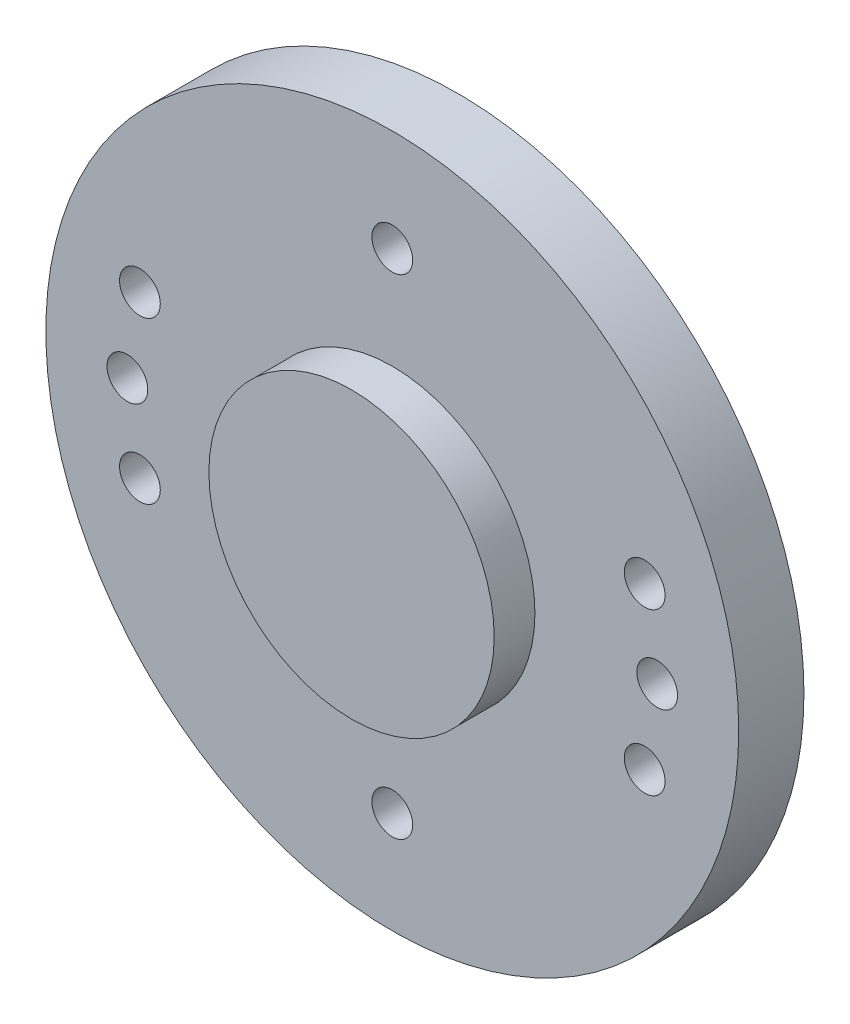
ISO-10303-21;
HEADER;
FILE_DESCRIPTION(('STEP AP214'),'2;1');
FILE_NAME('part.step','',(''),(''),'','','');
FILE_SCHEMA(('AUTOMOTIVE_DESIGN { 1 0 10303 214 1 1 1 1 }'));
ENDSEC;
DATA;
#1=APPLICATION_CONTEXT('core data for automotive mechanical design processes');
#2=APPLICATION_PROTOCOL_DEFINITION('international standard','automotive_design',2000,#1);
#3=PRODUCT_CONTEXT('',#1,'mechanical');
#4=PRODUCT('Part','Part','',(#3));
#5=PRODUCT_RELATED_PRODUCT_CATEGORY('part','',(#4));
#6=PRODUCT_DEFINITION_FORMATION('','',#4);
#7=PRODUCT_DEFINITION_CONTEXT('part definition',#1,'design');
#8=PRODUCT_DEFINITION('design','',#6,#7);
#9=PRODUCT_DEFINITION_SHAPE('','',#8);
#10=(LENGTH_UNIT() NAMED_UNIT(*) SI_UNIT(.MILLI.,.METRE.));
#11=(NAMED_UNIT(*) PLANE_ANGLE_UNIT() SI_UNIT($,.RADIAN.));
#12=(NAMED_UNIT(*) SI_UNIT($,.STERADIAN.) SOLID_ANGLE_UNIT());
#13=UNCERTAINTY_MEASURE_WITH_UNIT(LENGTH_MEASURE(1.E-05),#10,'distance_accuracy_value','');
#14=(GEOMETRIC_REPRESENTATION_CONTEXT(3) GLOBAL_UNCERTAINTY_ASSIGNED_CONTEXT((#13)) GLOBAL_UNIT_ASSIGNED_CONTEXT((#10,
#11,#12)) REPRESENTATION_CONTEXT('',''));
#15=CARTESIAN_POINT('',(0.,0.,0.));
#16=DIRECTION('',(0.,0.,1.));
#17=DIRECTION('',(1.,0.,0.));
#18=AXIS2_PLACEMENT_3D('',#15,#16,#17);
#19=CARTESIAN_POINT('',(0.,0.,0.));
#20=DIRECTION('',(0.,0.,1.));
#21=DIRECTION('',(1.,0.,0.));
#22=AXIS2_PLACEMENT_3D('',#19,#20,#21);
#23=PLANE('',#22);
#24=CARTESIAN_POINT('',(6.19230769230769,1.97618962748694,0.));
#25=DIRECTION('',(0.,0.,1.));
#26=DIRECTION('',(1.,0.,0.));
#27=AXIS2_PLACEMENT_3D('',#24,#25,#26);
#28=CIRCLE('',#27,0.500000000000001);
#29=CARTESIAN_POINT('',(6.69230769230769,1.97618962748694,0.));
#30=VERTEX_POINT('',#29);
#31=EDGE_CURVE('E100',#30,#30,#28,.T.);
#32=ORIENTED_EDGE('',*,*,#31,.T.);
#33=EDGE_LOOP('',(#32));
#34=FACE_BOUND('',#33,.T.);
#35=CARTESIAN_POINT('',(6.5,0.,0.));
#36=DIRECTION('',(0.,0.,1.));
#37=DIRECTION('',(1.,0.,0.));
#38=AXIS2_PLACEMENT_3D('',#35,#36,#37);
#39=CIRCLE('',#38,0.500000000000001);
#40=CARTESIAN_POINT('',(7.,0.,0.));
#41=VERTEX_POINT('',#40);
#42=EDGE_CURVE('E94',#41,#41,#39,.T.);
#43=ORIENTED_EDGE('',*,*,#42,.T.);
#44=EDGE_LOOP('',(#43));
#45=FACE_BOUND('',#44,.T.);
#46=CARTESIAN_POINT('',(6.19230769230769,-1.97618962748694,0.));
#47=DIRECTION('',(0.,0.,1.));
#48=DIRECTION('',(1.,0.,0.));
#49=AXIS2_PLACEMENT_3D('',#46,#47,#48);
#50=CIRCLE('',#49,0.500000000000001);
#51=CARTESIAN_POINT('',(6.69230769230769,-1.97618962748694,0.));
#52=VERTEX_POINT('',#51);
#53=EDGE_CURVE('E88',#52,#52,#50,.T.);
#54=ORIENTED_EDGE('',*,*,#53,.T.);
#55=EDGE_LOOP('',(#54));
#56=FACE_BOUND('',#55,.T.);
#57=CARTESIAN_POINT('',(-6.19230769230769,1.97618962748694,0.));
#58=DIRECTION('',(0.,0.,1.));
#59=DIRECTION('',(1.,0.,0.));
#60=AXIS2_PLACEMENT_3D('',#57,#58,#59);
#61=CIRCLE('',#60,0.5);
#62=CARTESIAN_POINT('',(-5.69230769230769,1.97618962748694,0.));
#63=VERTEX_POINT('',#62);
#64=EDGE_CURVE('E82',#63,#63,#61,.T.);
#65=ORIENTED_EDGE('',*,*,#64,.T.);
#66=EDGE_LOOP('',(#65));
#67=FACE_BOUND('',#66,.T.);
#68=CARTESIAN_POINT('',(-6.5,0.,0.));
#69=DIRECTION('',(0.,0.,1.));
#70=DIRECTION('',(1.,0.,0.));
#71=AXIS2_PLACEMENT_3D('',#68,#69,#70);
#72=CIRCLE('',#71,0.5);
#73=CARTESIAN_POINT('',(-6.,0.,0.));
#74=VERTEX_POINT('',#73);
#75=EDGE_CURVE('E76',#74,#74,#72,.T.);
#76=ORIENTED_EDGE('',*,*,#75,.T.);
#77=EDGE_LOOP('',(#76));
#78=FACE_BOUND('',#77,.T.);
#79=CARTESIAN_POINT('',(-6.19230769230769,-1.97618962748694,0.));
#80=DIRECTION('',(0.,0.,1.));
#81=DIRECTION('',(1.,0.,0.));
#82=AXIS2_PLACEMENT_3D('',#79,#80,#81);
#83=CIRCLE('',#82,0.5);
#84=CARTESIAN_POINT('',(-5.69230769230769,-1.97618962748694,0.));
#85=VERTEX_POINT('',#84);
#86=EDGE_CURVE('E70',#85,#85,#83,.T.);
#87=ORIENTED_EDGE('',*,*,#86,.T.);
#88=EDGE_LOOP('',(#87));
#89=FACE_BOUND('',#88,.T.);
#90=CARTESIAN_POINT('',(0.,-6.,0.));
#91=DIRECTION('',(0.,0.,1.));
#92=DIRECTION('',(1.,0.,0.));
#93=AXIS2_PLACEMENT_3D('',#90,#91,#92);
#94=CIRCLE('',#93,0.5);
#95=CARTESIAN_POINT('',(0.500000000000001,-6.,0.));
#96=VERTEX_POINT('',#95);
#97=EDGE_CURVE('E64',#96,#96,#94,.T.);
#98=ORIENTED_EDGE('',*,*,#97,.T.);
#99=EDGE_LOOP('',(#98));
#100=FACE_BOUND('',#99,.T.);
#101=CARTESIAN_POINT('',(0.,6.,0.));
#102=DIRECTION('',(0.,0.,1.));
#103=DIRECTION('',(1.,0.,0.));
#104=AXIS2_PLACEMENT_3D('',#101,#102,#103);
#105=CIRCLE('',#104,0.5);
#106=CARTESIAN_POINT('',(0.500000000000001,6.,0.));
#107=VERTEX_POINT('',#106);
#108=EDGE_CURVE('E58',#107,#107,#105,.T.);
#109=ORIENTED_EDGE('',*,*,#108,.T.);
#110=EDGE_LOOP('',(#109));
#111=FACE_BOUND('',#110,.T.);
#112=CARTESIAN_POINT('',(0.,0.,0.));
#113=DIRECTION('',(0.,0.,1.));
#114=DIRECTION('',(1.,0.,0.));
#115=AXIS2_PLACEMENT_3D('',#112,#113,#114);
#116=CIRCLE('',#115,8.5);
#117=CARTESIAN_POINT('',(8.5,0.,0.));
#118=VERTEX_POINT('',#117);
#119=EDGE_CURVE('E43',#118,#118,#116,.T.);
#120=ORIENTED_EDGE('',*,*,#119,.F.);
#121=EDGE_LOOP('',(#120));
#122=FACE_BOUND('',#121,.T.);
#123=CARTESIAN_POINT('',(0.,0.,0.));
#124=DIRECTION('',(0.,0.,1.));
#125=DIRECTION('',(1.,0.,0.));
#126=AXIS2_PLACEMENT_3D('',#123,#124,#125);
#127=CIRCLE('',#126,4.);
#128=CARTESIAN_POINT('',(4.,0.,0.));
#129=VERTEX_POINT('',#128);
#130=EDGE_CURVE('E10',#129,#129,#127,.F.);
#131=ORIENTED_EDGE('',*,*,#130,.F.);
#132=EDGE_LOOP('',(#131));
#133=FACE_BOUND('',#132,.T.);
#134=ADVANCED_FACE('F32',(#34,#45,#56,#67,#78,#89,#100,#111,#122,#133),#23,.F.);
#135=CARTESIAN_POINT('',(0.,0.,1.6));
#136=DIRECTION('',(0.,0.,1.));
#137=DIRECTION('',(1.,0.,0.));
#138=AXIS2_PLACEMENT_3D('',#135,#136,#137);
#139=PLANE('',#138);
#140=CARTESIAN_POINT('',(6.19230769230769,1.97618962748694,1.6));
#141=DIRECTION('',(0.,0.,1.));
#142=DIRECTION('',(1.,0.,0.));
#143=AXIS2_PLACEMENT_3D('',#140,#141,#142);
#144=CIRCLE('',#143,0.500000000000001);
#145=CARTESIAN_POINT('',(6.69230769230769,1.97618962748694,1.6));
#146=VERTEX_POINT('',#145);
#147=EDGE_CURVE('E103',#146,#146,#144,.T.);
#148=ORIENTED_EDGE('',*,*,#147,.F.);
#149=EDGE_LOOP('',(#148));
#150=FACE_BOUND('',#149,.T.);
#151=CARTESIAN_POINT('',(6.5,0.,1.6));
#152=DIRECTION('',(0.,0.,1.));
#153=DIRECTION('',(1.,0.,0.));
#154=AXIS2_PLACEMENT_3D('',#151,#152,#153);
#155=CIRCLE('',#154,0.500000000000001);
#156=CARTESIAN_POINT('',(7.,0.,1.6));
#157=VERTEX_POINT('',#156);
#158=EDGE_CURVE('E97',#157,#157,#155,.T.);
#159=ORIENTED_EDGE('',*,*,#158,.F.);
#160=EDGE_LOOP('',(#159));
#161=FACE_BOUND('',#160,.T.);
#162=CARTESIAN_POINT('',(6.19230769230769,-1.97618962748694,1.6));
#163=DIRECTION('',(0.,0.,1.));
#164=DIRECTION('',(1.,0.,0.));
#165=AXIS2_PLACEMENT_3D('',#162,#163,#164);
#166=CIRCLE('',#165,0.500000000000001);
#167=CARTESIAN_POINT('',(6.69230769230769,-1.97618962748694,1.6));
#168=VERTEX_POINT('',#167);
#169=EDGE_CURVE('E91',#168,#168,#166,.T.);
#170=ORIENTED_EDGE('',*,*,#169,.F.);
#171=EDGE_LOOP('',(#170));
#172=FACE_BOUND('',#171,.T.);
#173=CARTESIAN_POINT('',(-6.19230769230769,1.97618962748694,1.6));
#174=DIRECTION('',(0.,0.,1.));
#175=DIRECTION('',(1.,0.,0.));
#176=AXIS2_PLACEMENT_3D('',#173,#174,#175);
#177=CIRCLE('',#176,0.5);
#178=CARTESIAN_POINT('',(-5.69230769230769,1.97618962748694,1.6));
#179=VERTEX_POINT('',#178);
#180=EDGE_CURVE('E85',#179,#179,#177,.T.);
#181=ORIENTED_EDGE('',*,*,#180,.F.);
#182=EDGE_LOOP('',(#181));
#183=FACE_BOUND('',#182,.T.);
#184=CARTESIAN_POINT('',(-6.5,0.,1.6));
#185=DIRECTION('',(0.,0.,1.));
#186=DIRECTION('',(1.,0.,0.));
#187=AXIS2_PLACEMENT_3D('',#184,#185,#186);
#188=CIRCLE('',#187,0.5);
#189=CARTESIAN_POINT('',(-6.,0.,1.6));
#190=VERTEX_POINT('',#189);
#191=EDGE_CURVE('E79',#190,#190,#188,.T.);
#192=ORIENTED_EDGE('',*,*,#191,.F.);
#193=EDGE_LOOP('',(#192));
#194=FACE_BOUND('',#193,.T.);
#195=CARTESIAN_POINT('',(-6.19230769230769,-1.97618962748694,1.6));
#196=DIRECTION('',(0.,0.,1.));
#197=DIRECTION('',(1.,0.,0.));
#198=AXIS2_PLACEMENT_3D('',#195,#196,#197);
#199=CIRCLE('',#198,0.5);
#200=CARTESIAN_POINT('',(-5.69230769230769,-1.97618962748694,1.6));
#201=VERTEX_POINT('',#200);
#202=EDGE_CURVE('E73',#201,#201,#199,.T.);
#203=ORIENTED_EDGE('',*,*,#202,.F.);
#204=EDGE_LOOP('',(#203));
#205=FACE_BOUND('',#204,.T.);
#206=CARTESIAN_POINT('',(0.,-6.,1.6));
#207=DIRECTION('',(0.,0.,1.));
#208=DIRECTION('',(1.,0.,0.));
#209=AXIS2_PLACEMENT_3D('',#206,#207,#208);
#210=CIRCLE('',#209,0.5);
#211=CARTESIAN_POINT('',(0.500000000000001,-6.,1.6));
#212=VERTEX_POINT('',#211);
#213=EDGE_CURVE('E67',#212,#212,#210,.T.);
#214=ORIENTED_EDGE('',*,*,#213,.F.);
#215=EDGE_LOOP('',(#214));
#216=FACE_BOUND('',#215,.T.);
#217=CARTESIAN_POINT('',(0.,6.,1.6));
#218=DIRECTION('',(0.,0.,1.));
#219=DIRECTION('',(1.,0.,0.));
#220=AXIS2_PLACEMENT_3D('',#217,#218,#219);
#221=CIRCLE('',#220,0.5);
#222=CARTESIAN_POINT('',(0.500000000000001,6.,1.6));
#223=VERTEX_POINT('',#222);
#224=EDGE_CURVE('E61',#223,#223,#221,.T.);
#225=ORIENTED_EDGE('',*,*,#224,.F.);
#226=EDGE_LOOP('',(#225));
#227=FACE_BOUND('',#226,.T.);
#228=CARTESIAN_POINT('',(0.,0.,1.6));
#229=DIRECTION('',(0.,0.,1.));
#230=DIRECTION('',(1.,0.,0.));
#231=AXIS2_PLACEMENT_3D('',#228,#229,#230);
#232=CIRCLE('',#231,8.5);
#233=CARTESIAN_POINT('',(8.5,0.,1.6));
#234=VERTEX_POINT('',#233);
#235=EDGE_CURVE('E39',#234,#234,#232,.T.);
#236=ORIENTED_EDGE('',*,*,#235,.T.);
#237=EDGE_LOOP('',(#236));
#238=FACE_BOUND('',#237,.T.);
#239=CARTESIAN_POINT('',(0.,0.,1.6));
#240=DIRECTION('',(0.,0.,1.));
#241=DIRECTION('',(1.,0.,0.));
#242=AXIS2_PLACEMENT_3D('',#239,#240,#241);
#243=CIRCLE('',#242,3.5);
#244=CARTESIAN_POINT('',(3.5,0.,1.6));
#245=VERTEX_POINT('',#244);
#246=EDGE_CURVE('E50',#245,#245,#243,.T.);
#247=ORIENTED_EDGE('',*,*,#246,.F.);
#248=EDGE_LOOP('',(#247));
#249=FACE_BOUND('',#248,.T.);
#250=ADVANCED_FACE('F140',(#150,#161,#172,#183,#194,#205,#216,#227,#238,#249),#139,.T.);
#251=CARTESIAN_POINT('',(0.,0.,1.6));
#252=DIRECTION('',(0.,0.,-1.));
#253=DIRECTION('',(-1.,0.,0.));
#254=AXIS2_PLACEMENT_3D('',#251,#252,#253);
#255=CYLINDRICAL_SURFACE('',#254,8.5);
#256=ORIENTED_EDGE('',*,*,#235,.F.);
#257=EDGE_LOOP('',(#256));
#258=FACE_BOUND('',#257,.T.);
#259=ORIENTED_EDGE('',*,*,#119,.T.);
#260=EDGE_LOOP('',(#259));
#261=FACE_BOUND('',#260,.T.);
#262=ADVANCED_FACE('F34',(#258,#261),#255,.T.);
#263=CARTESIAN_POINT('',(0.,0.,2.6));
#264=DIRECTION('',(0.,0.,-1.));
#265=DIRECTION('',(-1.,0.,0.));
#266=AXIS2_PLACEMENT_3D('',#263,#264,#265);
#267=CYLINDRICAL_SURFACE('',#266,3.5);
#268=CARTESIAN_POINT('',(0.,0.,2.6));
#269=DIRECTION('',(0.,0.,1.));
#270=DIRECTION('',(1.,0.,0.));
#271=AXIS2_PLACEMENT_3D('',#268,#269,#270);
#272=CIRCLE('',#271,3.5);
#273=CARTESIAN_POINT('',(3.5,0.,2.6));
#274=VERTEX_POINT('',#273);
#275=EDGE_CURVE('E48',#274,#274,#272,.T.);
#276=ORIENTED_EDGE('',*,*,#275,.F.);
#277=EDGE_LOOP('',(#276));
#278=FACE_BOUND('',#277,.T.);
#279=ORIENTED_EDGE('',*,*,#246,.T.);
#280=EDGE_LOOP('',(#279));
#281=FACE_BOUND('',#280,.T.);
#282=ADVANCED_FACE('F136',(#278,#281),#267,.T.);
#283=CARTESIAN_POINT('',(0.,0.,2.6));
#284=DIRECTION('',(0.,0.,1.));
#285=DIRECTION('',(1.,0.,0.));
#286=AXIS2_PLACEMENT_3D('',#283,#284,#285);
#287=PLANE('',#286);
#288=ORIENTED_EDGE('',*,*,#275,.T.);
#289=EDGE_LOOP('',(#288));
#290=FACE_BOUND('',#289,.T.);
#291=ADVANCED_FACE('F131',(#290),#287,.T.);
#292=CARTESIAN_POINT('',(0.,0.,-2.5));
#293=DIRECTION('',(0.,0.,1.));
#294=DIRECTION('',(1.,0.,0.));
#295=AXIS2_PLACEMENT_3D('',#292,#293,#294);
#296=CYLINDRICAL_SURFACE('',#295,4.);
#297=CARTESIAN_POINT('',(0.,0.,-2.5));
#298=DIRECTION('',(0.,0.,-1.));
#299=DIRECTION('',(-1.,0.,0.));
#300=AXIS2_PLACEMENT_3D('',#297,#298,#299);
#301=CIRCLE('',#300,4.);
#302=CARTESIAN_POINT('',(-4.,0.,-2.5));
#303=VERTEX_POINT('',#302);
#304=EDGE_CURVE('E53',#303,#303,#301,.T.);
#305=ORIENTED_EDGE('',*,*,#304,.F.);
#306=EDGE_LOOP('',(#305));
#307=FACE_BOUND('',#306,.T.);
#308=ORIENTED_EDGE('',*,*,#130,.T.);
#309=EDGE_LOOP('',(#308));
#310=FACE_BOUND('',#309,.T.);
#311=ADVANCED_FACE('F126',(#307,#310),#296,.T.);
#312=CARTESIAN_POINT('',(0.,0.,-2.5));
#313=DIRECTION('',(0.,0.,-1.));
#314=DIRECTION('',(-1.,0.,0.));
#315=AXIS2_PLACEMENT_3D('',#312,#313,#314);
#316=PLANE('',#315);
#317=CARTESIAN_POINT('',(0.,0.,-2.5));
#318=DIRECTION('',(0.,0.,-1.));
#319=DIRECTION('',(-1.,0.,0.));
#320=AXIS2_PLACEMENT_3D('',#317,#318,#319);
#321=CIRCLE('',#320,2.9);
#322=CARTESIAN_POINT('',(-2.9,0.,-2.5));
#323=VERTEX_POINT('',#322);
#324=EDGE_CURVE('E107',#323,#323,#321,.T.);
#325=ORIENTED_EDGE('',*,*,#324,.F.);
#326=EDGE_LOOP('',(#325));
#327=FACE_BOUND('',#326,.T.);
#328=ORIENTED_EDGE('',*,*,#304,.T.);
#329=EDGE_LOOP('',(#328));
#330=FACE_BOUND('',#329,.T.);
#331=ADVANCED_FACE('F122',(#327,#330),#316,.T.);
#332=CARTESIAN_POINT('',(0.,6.,-2.5));
#333=DIRECTION('',(0.,0.,1.));
#334=DIRECTION('',(1.,0.,0.));
#335=AXIS2_PLACEMENT_3D('',#332,#333,#334);
#336=CYLINDRICAL_SURFACE('',#335,0.5);
#337=ORIENTED_EDGE('',*,*,#224,.T.);
#338=EDGE_LOOP('',(#337));
#339=FACE_BOUND('',#338,.T.);
#340=ORIENTED_EDGE('',*,*,#108,.F.);
#341=EDGE_LOOP('',(#340));
#342=FACE_BOUND('',#341,.T.);
#343=ADVANCED_FACE('F125',(#339,#342),#336,.F.);
#344=CARTESIAN_POINT('',(0.,-6.,-2.5));
#345=DIRECTION('',(0.,0.,1.));
#346=DIRECTION('',(1.,0.,0.));
#347=AXIS2_PLACEMENT_3D('',#344,#345,#346);
#348=CYLINDRICAL_SURFACE('',#347,0.5);
#349=ORIENTED_EDGE('',*,*,#213,.T.);
#350=EDGE_LOOP('',(#349));
#351=FACE_BOUND('',#350,.T.);
#352=ORIENTED_EDGE('',*,*,#97,.F.);
#353=EDGE_LOOP('',(#352));
#354=FACE_BOUND('',#353,.T.);
#355=ADVANCED_FACE('F181',(#351,#354),#348,.F.);
#356=CARTESIAN_POINT('',(-6.19230769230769,-1.97618962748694,-2.5));
#357=DIRECTION('',(0.,0.,1.));
#358=DIRECTION('',(1.,0.,0.));
#359=AXIS2_PLACEMENT_3D('',#356,#357,#358);
#360=CYLINDRICAL_SURFACE('',#359,0.5);
#361=ORIENTED_EDGE('',*,*,#202,.T.);
#362=EDGE_LOOP('',(#361));
#363=FACE_BOUND('',#362,.T.);
#364=ORIENTED_EDGE('',*,*,#86,.F.);
#365=EDGE_LOOP('',(#364));
#366=FACE_BOUND('',#365,.T.);
#367=ADVANCED_FACE('F192',(#363,#366),#360,.F.);
#368=CARTESIAN_POINT('',(-6.5,0.,-2.5));
#369=DIRECTION('',(0.,0.,1.));
#370=DIRECTION('',(1.,0.,0.));
#371=AXIS2_PLACEMENT_3D('',#368,#369,#370);
#372=CYLINDRICAL_SURFACE('',#371,0.5);
#373=ORIENTED_EDGE('',*,*,#191,.T.);
#374=EDGE_LOOP('',(#373));
#375=FACE_BOUND('',#374,.T.);
#376=ORIENTED_EDGE('',*,*,#75,.F.);
#377=EDGE_LOOP('',(#376));
#378=FACE_BOUND('',#377,.T.);
#379=ADVANCED_FACE('F202',(#375,#378),#372,.F.);
#380=CARTESIAN_POINT('',(-6.19230769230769,1.97618962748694,-2.5));
#381=DIRECTION('',(0.,0.,1.));
#382=DIRECTION('',(1.,0.,0.));
#383=AXIS2_PLACEMENT_3D('',#380,#381,#382);
#384=CYLINDRICAL_SURFACE('',#383,0.5);
#385=ORIENTED_EDGE('',*,*,#180,.T.);
#386=EDGE_LOOP('',(#385));
#387=FACE_BOUND('',#386,.T.);
#388=ORIENTED_EDGE('',*,*,#64,.F.);
#389=EDGE_LOOP('',(#388));
#390=FACE_BOUND('',#389,.T.);
#391=ADVANCED_FACE('F212',(#387,#390),#384,.F.);
#392=CARTESIAN_POINT('',(6.19230769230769,-1.97618962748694,-2.5));
#393=DIRECTION('',(0.,0.,1.));
#394=DIRECTION('',(1.,0.,0.));
#395=AXIS2_PLACEMENT_3D('',#392,#393,#394);
#396=CYLINDRICAL_SURFACE('',#395,0.500000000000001);
#397=ORIENTED_EDGE('',*,*,#169,.T.);
#398=EDGE_LOOP('',(#397));
#399=FACE_BOUND('',#398,.T.);
#400=ORIENTED_EDGE('',*,*,#53,.F.);
#401=EDGE_LOOP('',(#400));
#402=FACE_BOUND('',#401,.T.);
#403=ADVANCED_FACE('F222',(#399,#402),#396,.F.);
#404=CARTESIAN_POINT('',(6.5,0.,-2.5));
#405=DIRECTION('',(0.,0.,1.));
#406=DIRECTION('',(1.,0.,0.));
#407=AXIS2_PLACEMENT_3D('',#404,#405,#406);
#408=CYLINDRICAL_SURFACE('',#407,0.500000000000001);
#409=ORIENTED_EDGE('',*,*,#158,.T.);
#410=EDGE_LOOP('',(#409));
#411=FACE_BOUND('',#410,.T.);
#412=ORIENTED_EDGE('',*,*,#42,.F.);
#413=EDGE_LOOP('',(#412));
#414=FACE_BOUND('',#413,.T.);
#415=ADVANCED_FACE('F232',(#411,#414),#408,.F.);
#416=CARTESIAN_POINT('',(6.19230769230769,1.97618962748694,-2.5));
#417=DIRECTION('',(0.,0.,1.));
#418=DIRECTION('',(1.,0.,0.));
#419=AXIS2_PLACEMENT_3D('',#416,#417,#418);
#420=CYLINDRICAL_SURFACE('',#419,0.500000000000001);
#421=ORIENTED_EDGE('',*,*,#147,.T.);
#422=EDGE_LOOP('',(#421));
#423=FACE_BOUND('',#422,.T.);
#424=ORIENTED_EDGE('',*,*,#31,.F.);
#425=EDGE_LOOP('',(#424));
#426=FACE_BOUND('',#425,.T.);
#427=ADVANCED_FACE('F118',(#423,#426),#420,.F.);
#428=CARTESIAN_POINT('',(0.,0.,0.2));
#429=DIRECTION('',(0.,0.,-1.));
#430=DIRECTION('',(-1.,0.,0.));
#431=AXIS2_PLACEMENT_3D('',#428,#429,#430);
#432=CYLINDRICAL_SURFACE('',#431,2.9);
#433=CARTESIAN_POINT('',(0.,0.,0.2));
#434=DIRECTION('',(0.,0.,-1.));
#435=DIRECTION('',(-1.,0.,0.));
#436=AXIS2_PLACEMENT_3D('',#433,#434,#435);
#437=CIRCLE('',#436,2.9);
#438=CARTESIAN_POINT('',(-2.9,0.,0.2));
#439=VERTEX_POINT('',#438);
#440=EDGE_CURVE('E106',#439,#439,#437,.T.);
#441=CARTESIAN_POINT('',(-2.9,0.,0.2));
#442=CARTESIAN_POINT('',(-2.9,0.,0.171875));
#443=CARTESIAN_POINT('',(-2.9,0.,0.14375));
#444=CARTESIAN_POINT('',(-2.9,0.,0.0875000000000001));
#445=CARTESIAN_POINT('',(-2.9,0.,0.0593750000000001));
#446=CARTESIAN_POINT('',(-2.9,0.,0.00312500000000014));
#447=CARTESIAN_POINT('',(-2.9,0.,-0.0249999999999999));
#448=CARTESIAN_POINT('',(-2.9,0.,-0.0812499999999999));
#449=CARTESIAN_POINT('',(-2.9,0.,-0.109375));
#450=CARTESIAN_POINT('',(-2.9,0.,-0.165625));
#451=CARTESIAN_POINT('',(-2.9,0.,-0.19375));
#452=CARTESIAN_POINT('',(-2.9,0.,-0.25));
#453=CARTESIAN_POINT('',(-2.9,0.,-0.278125));
#454=CARTESIAN_POINT('',(-2.9,0.,-0.334375));
#455=CARTESIAN_POINT('',(-2.9,0.,-0.3625));
#456=CARTESIAN_POINT('',(-2.9,0.,-0.41875));
#457=CARTESIAN_POINT('',(-2.9,0.,-0.446875));
#458=CARTESIAN_POINT('',(-2.9,0.,-0.503125));
#459=CARTESIAN_POINT('',(-2.9,0.,-0.53125));
#460=CARTESIAN_POINT('',(-2.9,0.,-0.5875));
#461=CARTESIAN_POINT('',(-2.9,0.,-0.615625));
#462=CARTESIAN_POINT('',(-2.9,0.,-0.671875));
#463=CARTESIAN_POINT('',(-2.9,0.,-0.7));
#464=CARTESIAN_POINT('',(-2.9,0.,-0.75625));
#465=CARTESIAN_POINT('',(-2.9,0.,-0.784375));
#466=CARTESIAN_POINT('',(-2.9,0.,-0.840625));
#467=CARTESIAN_POINT('',(-2.9,0.,-0.86875));
#468=CARTESIAN_POINT('',(-2.9,0.,-0.925));
#469=CARTESIAN_POINT('',(-2.9,0.,-0.953125));
#470=CARTESIAN_POINT('',(-2.9,0.,-1.009375));
#471=CARTESIAN_POINT('',(-2.9,0.,-1.0375));
#472=CARTESIAN_POINT('',(-2.9,0.,-1.09375));
#473=CARTESIAN_POINT('',(-2.9,0.,-1.121875));
#474=CARTESIAN_POINT('',(-2.9,0.,-1.178125));
#475=CARTESIAN_POINT('',(-2.9,0.,-1.20625));
#476=CARTESIAN_POINT('',(-2.9,0.,-1.2625));
#477=CARTESIAN_POINT('',(-2.9,0.,-1.290625));
#478=CARTESIAN_POINT('',(-2.9,0.,-1.346875));
#479=CARTESIAN_POINT('',(-2.9,0.,-1.375));
#480=CARTESIAN_POINT('',(-2.9,0.,-1.43125));
#481=CARTESIAN_POINT('',(-2.9,0.,-1.459375));
#482=CARTESIAN_POINT('',(-2.9,0.,-1.515625));
#483=CARTESIAN_POINT('',(-2.9,0.,-1.54375));
#484=CARTESIAN_POINT('',(-2.9,0.,-1.6));
#485=CARTESIAN_POINT('',(-2.9,0.,-1.628125));
#486=CARTESIAN_POINT('',(-2.9,0.,-1.684375));
#487=CARTESIAN_POINT('',(-2.9,0.,-1.7125));
#488=CARTESIAN_POINT('',(-2.9,0.,-1.76875));
#489=CARTESIAN_POINT('',(-2.9,0.,-1.796875));
#490=CARTESIAN_POINT('',(-2.9,0.,-1.853125));
#491=CARTESIAN_POINT('',(-2.9,0.,-1.88125));
#492=CARTESIAN_POINT('',(-2.9,0.,-1.9375));
#493=CARTESIAN_POINT('',(-2.9,0.,-1.965625));
#494=CARTESIAN_POINT('',(-2.9,0.,-2.021875));
#495=CARTESIAN_POINT('',(-2.9,0.,-2.05));
#496=CARTESIAN_POINT('',(-2.9,0.,-2.10625));
#497=CARTESIAN_POINT('',(-2.9,0.,-2.134375));
#498=CARTESIAN_POINT('',(-2.9,0.,-2.190625));
#499=CARTESIAN_POINT('',(-2.9,0.,-2.21875));
#500=CARTESIAN_POINT('',(-2.9,0.,-2.275));
#501=CARTESIAN_POINT('',(-2.9,0.,-2.303125));
#502=CARTESIAN_POINT('',(-2.9,0.,-2.359375));
#503=CARTESIAN_POINT('',(-2.9,0.,-2.3875));
#504=CARTESIAN_POINT('',(-2.9,0.,-2.44375));
#505=CARTESIAN_POINT('',(-2.9,0.,-2.471875));
#506=CARTESIAN_POINT('',(-2.9,0.,-2.5));
#507=B_SPLINE_CURVE_WITH_KNOTS('',3,(#441,#442,#443,#444,#445,#446,#447,#448,#449,#450,#451,
#452,#453,#454,#455,#456,#457,#458,#459,#460,#461,#462,#463,#464,#465,#466,#467,#468,#469,#470,
#471,#472,#473,#474,#475,#476,#477,#478,#479,#480,#481,#482,#483,#484,#485,#486,#487,#488,#489,
#490,#491,#492,#493,#494,#495,#496,#497,#498,#499,#500,#501,#502,#503,#504,#505,#506),
.UNSPECIFIED.,.F.,.F.,(4,2,2,2,2,2,2,2,2,2,2,2,2,2,2,2,2,2,2,2,2,2,2,2,2,2,2,2,2,2,2,2,4),(0.,
0.084375,0.16875,0.253125,0.3375,0.421875,0.50625,0.590625,0.675,0.759375,0.84375,0.928125,
1.0125,1.096875,1.18125,1.265625,1.35,1.434375,1.51875,1.603125,1.6875,1.771875,1.85625,
1.940625,2.025,2.109375,2.19375,2.278125,2.3625,2.446875,2.53125,2.615625,2.7),.UNSPECIFIED.);
#508=EDGE_CURVE('BSEAM115',#439,#323,#507,.T.);
#509=ORIENTED_EDGE('',*,*,#440,.F.);
#510=ORIENTED_EDGE('',*,*,#324,.T.);
#511=ORIENTED_EDGE('',*,*,#508,.T.);
#512=ORIENTED_EDGE('',*,*,#508,.F.);
#513=EDGE_LOOP('',(#509,#511,#510,#512));
#514=FACE_BOUND('',#513,.T.);
#515=ADVANCED_FACE('F115',(#514),#432,.F.);
#516=CARTESIAN_POINT('',(0.,0.,0.2));
#517=DIRECTION('',(0.,0.,-1.));
#518=DIRECTION('',(-1.,0.,0.));
#519=AXIS2_PLACEMENT_3D('',#516,#517,#518);
#520=PLANE('',#519);
#521=ORIENTED_EDGE('',*,*,#440,.T.);
#522=EDGE_LOOP('',(#521));
#523=FACE_BOUND('',#522,.T.);
#524=ADVANCED_FACE('F113',(#523),#520,.T.);
#525=CLOSED_SHELL('',(#134,#250,#262,#282,#291,#311,#331,#343,#355,#367,#379,#391,#403,#415,
#427,#515,#524));
#526=MANIFOLD_SOLID_BREP('B2',#525);
#527=ADVANCED_BREP_SHAPE_REPRESENTATION('',(#18,#526),#14);
#528=SHAPE_DEFINITION_REPRESENTATION(#9,#527);
ENDSEC;
END-ISO-10303-21;
